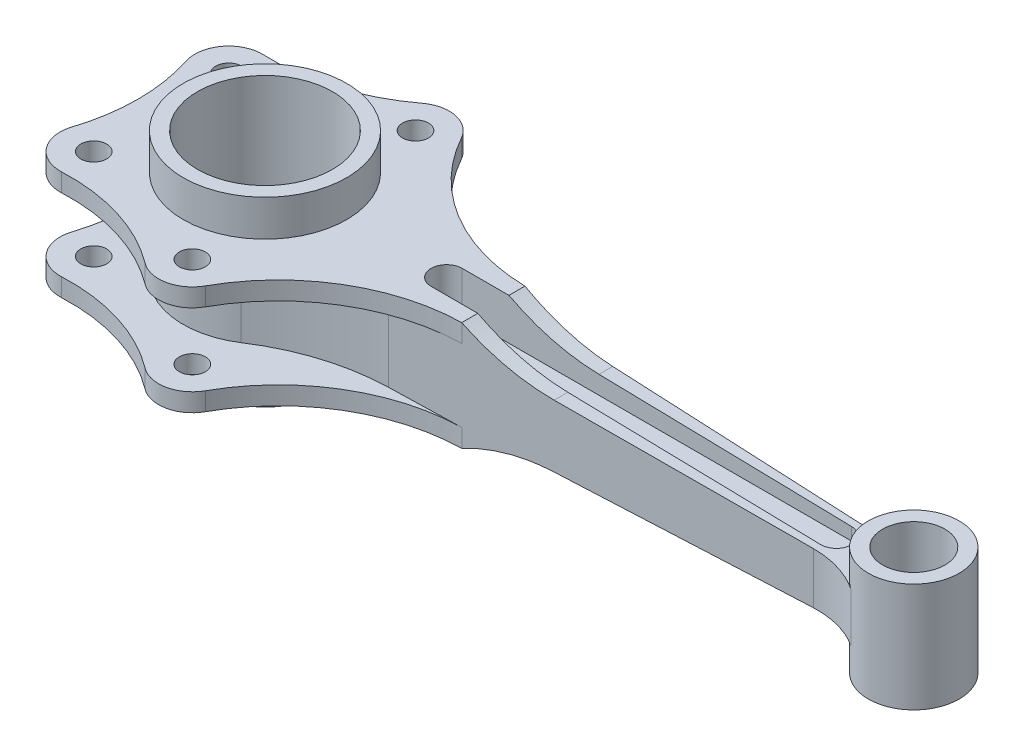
from build123d import *

# Parameters (mm, degrees)
SKETCH1_R                  = 26
BOSS_EXTRUDE3_DEPTH        = 35
BOSS_EXTRUDE4_DEPTH        = 21
SKETCH5_R                  = 31.499999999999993
BOSS_EXTRUDE6_DEPTH        = 7
CUT_EXTRUDE2_DEPTH         = 16
CUT_EXTRUDE1_DEPTH         = 21
SKETCH1_6_R                = 12.000000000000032
BOSS_EXTRUDE5_DEPTH        = 21
F_10_0_10_DIAMETER_HOLE1_D = 10


with BuildPart() as part:
    # Sketch1 → Boss-Extrude3 (new, symmetric)
    with BuildSketch(Plane(origin=(0, 0, 0), x_dir=(1, 0, 0), z_dir=(0, 1, 0))):
        with BuildLine():
            ThreePointArc((17.22281298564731, -26.374698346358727), (31.499999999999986, 2.66e-15), (17.22281298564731, 26.374698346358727))
            ThreePointArc((17.222812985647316, 26.374698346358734), (-31.5, 1.421e-14), (17.222812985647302, -26.37469834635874))
        make_face()
        with Locations(Location((0, 0, 0), (0, 0, 270))):
            Circle(SKETCH1_R, mode=Mode.SUBTRACT)
    extrude(amount=BOSS_EXTRUDE3_DEPTH, both=True)

    # Sketch1_5 → Boss-Extrude4 (add, symmetric)
    with BuildSketch(Plane(origin=(0, 0, 0), x_dir=(1, 0, 0), z_dir=(0, 1, 0))):
        with BuildLine():
            Line((220, 8.719912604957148), (60.430871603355, 12.898377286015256))
            ThreePointArc((60.430871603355, 12.898377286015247), (37.89050443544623, 16.634432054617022), (17.22281298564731, 26.374698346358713))
            ThreePointArc((17.22281298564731, 26.374698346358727), (27.701702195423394, 14.995522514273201), (31.499999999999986, 1.50013e-12))
            Line((31.499999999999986, 0), (232.5, 0))
            ThreePointArc((232.49999999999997, -3.5216e-13), (234.57428219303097, 8.264213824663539), (240.30539773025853, 14.569306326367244))
            ThreePointArc((240.30539773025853, 14.569306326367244), (230.60468578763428, 10.07559656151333), (220, 8.719912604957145))
        make_face()
        with BuildLine():
            ThreePointArc((31.499999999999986, 1.50013e-12), (27.701702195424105, -14.99552251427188), (17.22281298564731, -26.374698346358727))
            ThreePointArc((17.22281298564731, -26.374698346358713), (37.89050443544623, -16.634432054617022), (60.430871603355, -12.898377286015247))
            Line((60.430871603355, -12.898377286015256), (220, -8.719912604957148))
            ThreePointArc((220, -8.719912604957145), (230.60468578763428, -10.07559656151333), (240.30539773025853, -14.569306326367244))
            ThreePointArc((240.30539773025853, -14.569306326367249), (234.57428219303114, -8.264213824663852), (232.49999999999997, -3.5216e-13))
            Line((232.5, 0), (31.499999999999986, 0))
        make_face()
    extrude(amount=BOSS_EXTRUDE4_DEPTH, both=True)

    # Sketch5 → Boss-Extrude6 (add)
    with BuildSketch(Plane(origin=(0, 21, 0), x_dir=(1, 0, 0), z_dir=(0, 1, 0))):
        with BuildLine():
            Line((88, 12.178319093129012), (88, -12.178319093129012))
            ThreePointArc((88, -12.178319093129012), (52.21876329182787, -22.488553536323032), (26.37373907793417, -49.295876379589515))
            ThreePointArc((26.37373907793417, -49.295876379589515), (17.709961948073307, -55.71440546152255), (7.181946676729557, -53.38643549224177))
            ThreePointArc((7.181946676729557, -53.38643549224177), (-14.855989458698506, -42.12231883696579), (-39.4062886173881, -38.98643549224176))
            ThreePointArc((-39.4062886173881, -38.98643549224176), (-50.32695191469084, -33.89645896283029), (-52.376901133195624, -22.02352941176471))
            ThreePointArc((-52.376901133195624, -22.02352941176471), (-48.92589202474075, 0), (-52.376901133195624, 22.02352941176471))
            ThreePointArc((-52.376901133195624, 22.02352941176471), (-50.32695191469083, 33.89645896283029), (-39.4062886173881, 38.98643549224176))
            ThreePointArc((-39.4062886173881, 38.98643549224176), (-14.855989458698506, 42.12231883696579), (7.181946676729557, 53.38643549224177))
            ThreePointArc((7.181946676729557, 53.38643549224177), (17.709961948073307, 55.71440546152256), (26.37373907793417, 49.295876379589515))
            ThreePointArc((26.37373907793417, 49.295876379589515), (52.21876329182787, 22.488553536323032), (88, 12.178319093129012))
        make_face()
        with Locations(Location((0, 0, 0), (0, 0, 56.855257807))):
            Circle(SKETCH5_R, mode=Mode.SUBTRACT)
    boss_extrude6 = extrude(amount=-BOSS_EXTRUDE6_DEPTH)

    # Sketch3 → Cut-Extrude2 (cut)
    with BuildSketch(Plane(origin=(0, 21, 0), x_dir=(1, 0, 0), z_dir=(0, 1, 0))):
        with BuildLine():
            Line((69.99999999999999, 6), (220, 5.999999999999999))
            ThreePointArc((220, 5.999999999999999), (226, 0), (220, -5.999999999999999))
            Line((220, -5.999999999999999), (69.99999999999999, -6))
            ThreePointArc((69.99999999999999, -6), (63.999999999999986, 7.3e-16), (69.99999999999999, 6))
        make_face()
    cut_extrude2 = extrude(amount=-CUT_EXTRUDE2_DEPTH, mode=Mode.SUBTRACT)

    # Sketch2 → Cut-Extrude1 (cut, symmetric)
    with BuildSketch(Plane.XY):
        with BuildLine():
            Line((122.70669621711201, 12), (280, 8.567847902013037))
            Line((280, 8.567847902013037), (280, 21))
            Line((280, 21), (88, 21))
            ThreePointArc((88, 21), (104.82919796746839, 14.478720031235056), (122.70669621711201, 12))
        make_face()
    cut_extrude1 = extrude(amount=CUT_EXTRUDE1_DEPTH, both=True, mode=Mode.SUBTRACT)

    # Mirror1: Boss-Extrude6, Cut-Extrude2, Cut-Extrude1 across plane
    add(boss_extrude6.mirror(Plane.ZX))
    add(cut_extrude2.mirror(Plane.ZX), mode=Mode.SUBTRACT)
    add(cut_extrude1.mirror(Plane.ZX), mode=Mode.SUBTRACT)

    # Sketch1_6 → Boss-Extrude5 (add, symmetric)
    with BuildSketch(Plane(origin=(0, 0, 0), x_dir=(1, 0, 0), z_dir=(0, 1, 0))):
        with BuildLine():
            ThreePointArc((240.30539773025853, -14.569306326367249), (267.5, 3.55e-15), (240.30539773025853, 14.569306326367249))
            ThreePointArc((240.30539773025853, 14.569306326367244), (232.49999999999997, -4e-15), (240.30539773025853, -14.569306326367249))
        make_face()
        with Locations(Location((250, 0, 0), (0, 0, 90))):
            Circle(SKETCH1_6_R, mode=Mode.SUBTRACT)
    extrude(amount=BOSS_EXTRUDE5_DEPTH, both=True)

    # 10.0 _10_ Diameter Hole1 (through all)
    with Locations(Plane(origin=(0, 21, 0), x_dir=(-1, 0, 0), z_dir=(0, 1, 0))):
        with Locations((-15, -43)):
            f_10_0_10_diameter_hole1 = Hole(F_10_0_10_DIAMETER_HOLE1_D / 2)

    # Sketch-Pattern1: 10.0 _10_ Diameter Hole1 at 3 more places
    with Locations((-55, 0, 17), (-55, 0, 69), (0, 0, 86)):
        add(f_10_0_10_diameter_hole1, mode=Mode.SUBTRACT)


solid = part.part
